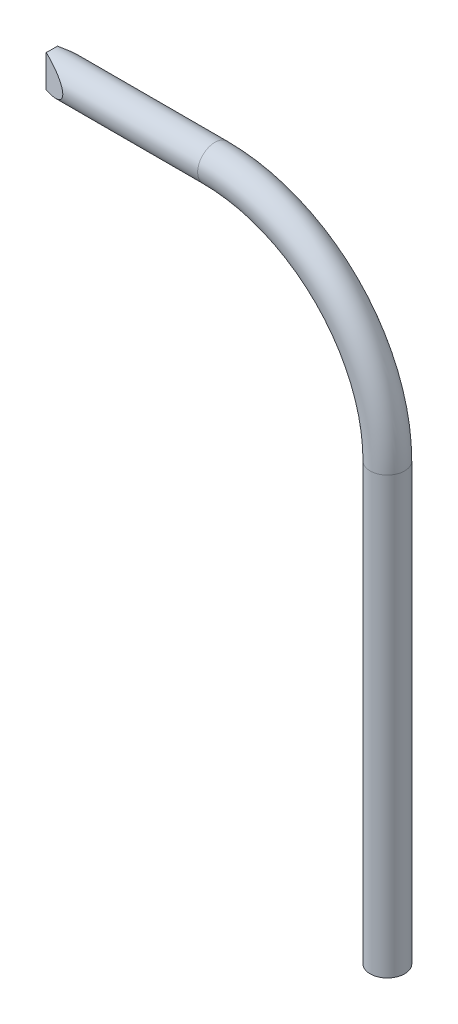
from build123d import *

# Parameters (mm, degrees)
ESQUISSE2_R             = 20
ENL_V_MAT_EXTRU_2_DEPTH = 1773
ESQUISSE5_R             = 16.85
ENL_V_MAT_EXTRU_3_DEPTH = 1773


with BuildPart() as part:
    # Balayage1: sweep along a path in Esquisse1
    with BuildLine(Plane.XY) as balayage1_path:
        Line((-317.337807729, 635), (-317.337807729, 1140))
        ThreePointArc((-317.337807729, 1140), (-375.916451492, 1281.421356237), (-517.337807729, 1340))
        Line((-517.337807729, 1340), (-721.11640748, 1340))
    # Esquisse2 → Balayage1 (sweep)
    with BuildSketch(Plane(origin=(-317.337807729, 635, 0), x_dir=(1, 0, 0), z_dir=(0, -1, 0))):
        Circle(ESQUISSE2_R)
    sweep(path=balayage1_path.line)

    # Esquisse3 → Enl_v. mat.-Extru.2 (cut)
    with BuildSketch(Plane(origin=(0, 0, 0), x_dir=(1, 0, 0), z_dir=(0, 1, 0))):
        Polygon((-722.012930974, 0), (-621.259868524, -41.733284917), (-809.988452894, -25.685219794), (-705.445343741, 137.09827249), (-597.407906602, 51.613091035), align=None)
    extrude(amount=ENL_V_MAT_EXTRU_2_DEPTH, mode=Mode.SUBTRACT)

    # Esquisse5 → Enl_v. mat.-Extru.3 (cut)
    with BuildSketch(Plane(origin=(0, 0, 0), x_dir=(1, 0, 0), z_dir=(0, 1, 0))):
        with Locations((-722.012930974, 0)):
            Circle(ESQUISSE5_R)
    extrude(amount=ENL_V_MAT_EXTRU_3_DEPTH, mode=Mode.SUBTRACT)


solid = part.part
